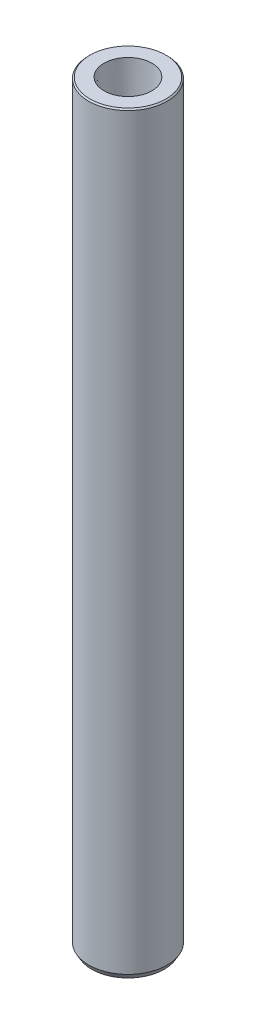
from build123d import *

# Parameters (mm, degrees)
SKETCH1_R          = 7.5
EXTRUDE1_DEPTH     = 144
CHAMFER1_SIZE      = 1
CHAMFER1_SIZE2     = 0.577350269
SKETCH2_R          = 4.5
CUT_EXTRUDE1_DEPTH = 17
CHAMFER2_SIZE      = 0.25
SKETCH5_R          = 4
CUT_EXTRUDE2_DEPTH = 200
CHAMFER3_SIZE      = 0.25


with BuildPart() as part:
    # Sketch1 → Extrude1 (new body)
    with BuildSketch(Plane(origin=(0, 0, 0), x_dir=(1, 0, 0), z_dir=(0, 1, 0))):
        with Locations(Location((0, 0, 0), (0, 0, 270))):
            Circle(SKETCH1_R)
    extrude(amount=EXTRUDE1_DEPTH)

    # Chamfer1
    chamfer1_edges = [part.edges().sort_by_distance(p)[0] for p in [
        (0, 0, -7.5),
    ]]
    chamfer1_side = [part.faces().sort_by_distance(p)[0] for p in [
        (0, 72, -7.5),
    ]]
    chamfer(chamfer1_edges, length=CHAMFER1_SIZE, length2=CHAMFER1_SIZE2, reference=chamfer1_side[0])

    # Sketch2 → Cut-Extrude1 (cut)
    with BuildSketch(Plane.XZ):
        with Locations(Location((0, 0, 0), (0, 0, 270))):
            Circle(SKETCH2_R)
    extrude(amount=-CUT_EXTRUDE1_DEPTH, mode=Mode.SUBTRACT)

    # Chamfer2
    chamfer2_edges = [part.edges().sort_by_distance(p)[0] for p in [
        (0, 144, -7.5),
    ]]
    chamfer(chamfer2_edges, length=CHAMFER2_SIZE)

    # Sketch5 → Cut-Extrude2 (cut)
    with BuildSketch(Plane(origin=(0, 144, 0), x_dir=(-1, 0, 0), z_dir=(0, 1, 0))):
        with Locations(Location((0, 0, 0), (0, 0, 90))):
            Circle(SKETCH5_R)
    extrude(amount=-CUT_EXTRUDE2_DEPTH, mode=Mode.SUBTRACT)

    # Chamfer3
    chamfer3_edges = [part.edges().sort_by_distance(p)[0] for p in [
        (0, 0, 4.5),
    ]]
    chamfer(chamfer3_edges, length=CHAMFER3_SIZE)

    # Sketch7 → 1_8 Rc Tapped Hole1 (revolve, cut)
    with BuildSketch(Plane(origin=(0, 144, 0), x_dir=(0, 0, 1), z_dir=(1, 0, 0))):
        Polygon((0, 0), (0, 14.308399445), (3.95, 11.935), (3.95, 7.4), (4.342497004, 7.4), (4.5735, 0), align=None)
    revolve(axis=Axis((0, 150.35, 0), (0, -1, 0)), mode=Mode.SUBTRACT)


solid = part.part
